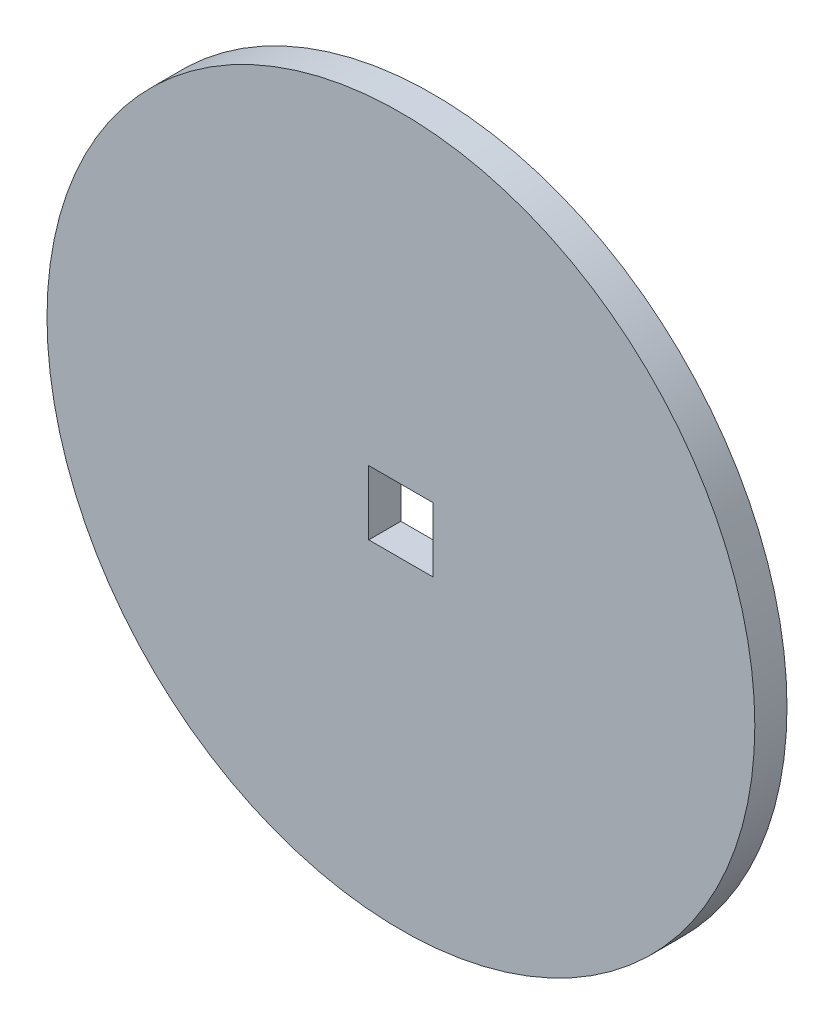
from build123d import *

# Parameters (mm, degrees)
SKETCH1_R           = 34.925
SKETCH1_W           = 6.35
SKETCH1_H           = 6.35
BOSS_EXTRUDE1_DEPTH = 3.175


with BuildPart() as part:
    # Sketch1 → Boss-Extrude1 (new body)
    with BuildSketch(Plane.XY):
        with Locations((-50.868418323, 26.44477265)):
            Circle(SKETCH1_R)
        with Locations((-50.868418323, 26.44477265)):
            Rectangle(SKETCH1_W, SKETCH1_H, mode=Mode.SUBTRACT)
    extrude(amount=BOSS_EXTRUDE1_DEPTH)


solid = part.part
